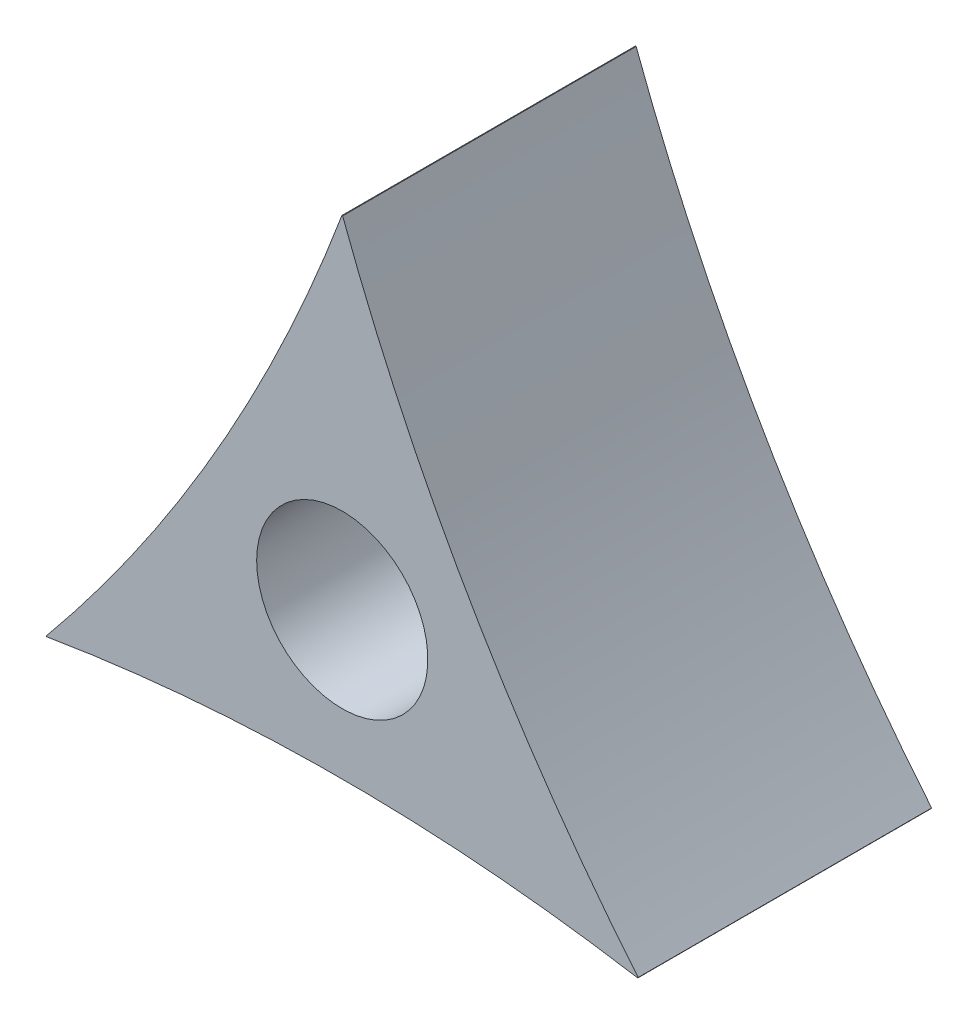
ISO-10303-21;
HEADER;
FILE_DESCRIPTION(('STEP AP214'),'2;1');
FILE_NAME('part.step','',(''),(''),'','','');
FILE_SCHEMA(('AUTOMOTIVE_DESIGN { 1 0 10303 214 1 1 1 1 }'));
ENDSEC;
DATA;
#1=APPLICATION_CONTEXT('core data for automotive mechanical design processes');
#2=APPLICATION_PROTOCOL_DEFINITION('international standard','automotive_design',2000,#1);
#3=PRODUCT_CONTEXT('',#1,'mechanical');
#4=PRODUCT('Part','Part','',(#3));
#5=PRODUCT_RELATED_PRODUCT_CATEGORY('part','',(#4));
#6=PRODUCT_DEFINITION_FORMATION('','',#4);
#7=PRODUCT_DEFINITION_CONTEXT('part definition',#1,'design');
#8=PRODUCT_DEFINITION('design','',#6,#7);
#9=PRODUCT_DEFINITION_SHAPE('','',#8);
#10=(LENGTH_UNIT() NAMED_UNIT(*) SI_UNIT(.MILLI.,.METRE.));
#11=(NAMED_UNIT(*) PLANE_ANGLE_UNIT() SI_UNIT($,.RADIAN.));
#12=(NAMED_UNIT(*) SI_UNIT($,.STERADIAN.) SOLID_ANGLE_UNIT());
#13=UNCERTAINTY_MEASURE_WITH_UNIT(LENGTH_MEASURE(1.E-05),#10,'distance_accuracy_value','');
#14=(GEOMETRIC_REPRESENTATION_CONTEXT(3) GLOBAL_UNCERTAINTY_ASSIGNED_CONTEXT((#13)) GLOBAL_UNIT_ASSIGNED_CONTEXT((#10,
#11,#12)) REPRESENTATION_CONTEXT('',''));
#15=CARTESIAN_POINT('',(0.,0.,0.));
#16=DIRECTION('',(0.,0.,1.));
#17=DIRECTION('',(1.,0.,0.));
#18=AXIS2_PLACEMENT_3D('',#15,#16,#17);
#19=CARTESIAN_POINT('',(-435.480557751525,-251.424817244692,152.4));
#20=DIRECTION('',(0.,0.,-1.));
#21=DIRECTION('',(-1.,0.,0.));
#22=AXIS2_PLACEMENT_3D('',#19,#20,#21);
#23=PLANE('',#22);
#24=CARTESIAN_POINT('',(0.,-1005.69926897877,152.4));
#25=DIRECTION('',(0.,0.,-1.));
#26=DIRECTION('',(1.,0.,0.));
#27=AXIS2_PLACEMENT_3D('',#24,#25,#26);
#28=CIRCLE('',#27,929.64);
#29=CARTESIAN_POINT('',(-153.444496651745,-88.8103356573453,152.4));
#30=VERTEX_POINT('',#29);
#31=CARTESIAN_POINT('',(153.444496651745,-88.8103356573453,152.4));
#32=VERTEX_POINT('',#31);
#33=EDGE_CURVE('E111',#30,#32,#28,.T.);
#34=ORIENTED_EDGE('',*,*,#33,.T.);
#35=DIRECTION('',(-0.500000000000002,-0.866025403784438,0.));
#36=VECTOR('',#35,1.);
#37=CARTESIAN_POINT('',(153.920375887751,-87.9860886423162,152.4));
#38=LINE('',#37,#36);
#39=CARTESIAN_POINT('',(153.634255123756,-88.4816643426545,152.4));
#40=VERTEX_POINT('',#39);
#41=EDGE_CURVE('E175',#40,#32,#38,.T.);
#42=ORIENTED_EDGE('',*,*,#41,.F.);
#43=CARTESIAN_POINT('',(870.961115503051,502.849634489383,152.4));
#44=DIRECTION('',(0.,0.,-1.));
#45=DIRECTION('',(-1.,0.,0.));
#46=AXIS2_PLACEMENT_3D('',#43,#44,#45);
#47=CIRCLE('',#46,929.64);
#48=CARTESIAN_POINT('',(0.189758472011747,177.292,152.4));
#49=VERTEX_POINT('',#48);
#50=EDGE_CURVE('E107',#40,#49,#47,.T.);
#51=ORIENTED_EDGE('',*,*,#50,.T.);
#52=DIRECTION('',(1.,0.,0.));
#53=VECTOR('',#52,1.);
#54=CARTESIAN_POINT('',(0.761999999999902,177.292,152.4));
#55=LINE('',#54,#53);
#56=CARTESIAN_POINT('',(-0.189758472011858,177.292,152.4));
#57=VERTEX_POINT('',#56);
#58=EDGE_CURVE('E59',#57,#49,#55,.T.);
#59=ORIENTED_EDGE('',*,*,#58,.F.);
#60=CARTESIAN_POINT('',(-870.961115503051,502.849634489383,152.4));
#61=DIRECTION('',(0.,0.,-1.));
#62=DIRECTION('',(-1.,0.,0.));
#63=AXIS2_PLACEMENT_3D('',#60,#61,#62);
#64=CIRCLE('',#63,929.64);
#65=CARTESIAN_POINT('',(-153.634255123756,-88.4816643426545,152.4));
#66=VERTEX_POINT('',#65);
#67=EDGE_CURVE('E104',#57,#66,#64,.T.);
#68=ORIENTED_EDGE('',*,*,#67,.T.);
#69=DIRECTION('',(-0.500000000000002,0.866025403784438,0.));
#70=VECTOR('',#69,1.);
#71=CARTESIAN_POINT('',(-153.920375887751,-87.9860886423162,152.4));
#72=LINE('',#71,#70);
#73=EDGE_CURVE('E139',#30,#66,#72,.T.);
#74=ORIENTED_EDGE('',*,*,#73,.F.);
#75=EDGE_LOOP('',(#34,#42,#51,#59,#68,#74));
#76=FACE_BOUND('',#75,.T.);
#77=CARTESIAN_POINT('',(0.,0.,152.4));
#78=DIRECTION('',(0.,0.,1.));
#79=DIRECTION('',(1.,0.,0.));
#80=AXIS2_PLACEMENT_3D('',#77,#78,#79);
#81=CIRCLE('',#80,44.45);
#82=CARTESIAN_POINT('',(-44.45,0.,152.4));
#83=VERTEX_POINT('',#82);
#84=EDGE_CURVE('E126',#83,#83,#81,.T.);
#85=ORIENTED_EDGE('',*,*,#84,.F.);
#86=EDGE_LOOP('',(#85));
#87=FACE_BOUND('',#86,.T.);
#88=ADVANCED_FACE('F37',(#76,#87),#23,.F.);
#89=CARTESIAN_POINT('',(-435.480557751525,-251.424817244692,0.));
#90=DIRECTION('',(0.,0.,-1.));
#91=DIRECTION('',(-1.,0.,0.));
#92=AXIS2_PLACEMENT_3D('',#89,#90,#91);
#93=PLANE('',#92);
#94=DIRECTION('',(-0.500000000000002,-0.866025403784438,0.));
#95=VECTOR('',#94,1.);
#96=CARTESIAN_POINT('',(153.920375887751,-87.9860886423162,0.));
#97=LINE('',#96,#95);
#98=CARTESIAN_POINT('',(153.634255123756,-88.4816643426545,0.));
#99=VERTEX_POINT('',#98);
#100=CARTESIAN_POINT('',(153.444496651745,-88.8103356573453,0.));
#101=VERTEX_POINT('',#100);
#102=EDGE_CURVE('E96',#99,#101,#97,.T.);
#103=ORIENTED_EDGE('',*,*,#102,.T.);
#104=CARTESIAN_POINT('',(0.,-1005.69926897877,0.));
#105=DIRECTION('',(0.,0.,-1.));
#106=DIRECTION('',(1.,0.,0.));
#107=AXIS2_PLACEMENT_3D('',#104,#105,#106);
#108=CIRCLE('',#107,929.64);
#109=CARTESIAN_POINT('',(-153.444496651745,-88.8103356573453,0.));
#110=VERTEX_POINT('',#109);
#111=EDGE_CURVE('E116',#110,#101,#108,.T.);
#112=ORIENTED_EDGE('',*,*,#111,.F.);
#113=DIRECTION('',(-0.500000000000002,0.866025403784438,0.));
#114=VECTOR('',#113,1.);
#115=CARTESIAN_POINT('',(-153.920375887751,-87.9860886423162,0.));
#116=LINE('',#115,#114);
#117=CARTESIAN_POINT('',(-153.634255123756,-88.4816643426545,0.));
#118=VERTEX_POINT('',#117);
#119=EDGE_CURVE('E52',#110,#118,#116,.T.);
#120=ORIENTED_EDGE('',*,*,#119,.T.);
#121=CARTESIAN_POINT('',(-870.961115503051,502.849634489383,0.));
#122=DIRECTION('',(0.,0.,-1.));
#123=DIRECTION('',(-1.,0.,0.));
#124=AXIS2_PLACEMENT_3D('',#121,#122,#123);
#125=CIRCLE('',#124,929.64);
#126=CARTESIAN_POINT('',(-0.189758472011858,177.292,0.));
#127=VERTEX_POINT('',#126);
#128=EDGE_CURVE('E124',#127,#118,#125,.T.);
#129=ORIENTED_EDGE('',*,*,#128,.F.);
#130=DIRECTION('',(1.,0.,0.));
#131=VECTOR('',#130,1.);
#132=CARTESIAN_POINT('',(0.761999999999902,177.292,0.));
#133=LINE('',#132,#131);
#134=CARTESIAN_POINT('',(0.189758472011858,177.292,0.));
#135=VERTEX_POINT('',#134);
#136=EDGE_CURVE('E90',#127,#135,#133,.T.);
#137=ORIENTED_EDGE('',*,*,#136,.T.);
#138=CARTESIAN_POINT('',(870.961115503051,502.849634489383,0.));
#139=DIRECTION('',(0.,0.,-1.));
#140=DIRECTION('',(-1.,0.,0.));
#141=AXIS2_PLACEMENT_3D('',#138,#139,#140);
#142=CIRCLE('',#141,929.64);
#143=EDGE_CURVE('E112',#99,#135,#142,.T.);
#144=ORIENTED_EDGE('',*,*,#143,.F.);
#145=EDGE_LOOP('',(#103,#112,#120,#129,#137,#144));
#146=FACE_BOUND('',#145,.T.);
#147=CARTESIAN_POINT('',(0.,0.,0.));
#148=DIRECTION('',(0.,0.,1.));
#149=DIRECTION('',(1.,0.,0.));
#150=AXIS2_PLACEMENT_3D('',#147,#148,#149);
#151=CIRCLE('',#150,44.45);
#152=CARTESIAN_POINT('',(-44.45,0.,0.));
#153=VERTEX_POINT('',#152);
#154=EDGE_CURVE('E119',#153,#153,#151,.T.);
#155=ORIENTED_EDGE('',*,*,#154,.T.);
#156=EDGE_LOOP('',(#155));
#157=FACE_BOUND('',#156,.T.);
#158=ADVANCED_FACE('F136',(#146,#157),#93,.T.);
#159=CARTESIAN_POINT('',(-870.961115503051,502.849634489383,152.4));
#160=DIRECTION('',(0.,0.,-1.));
#161=DIRECTION('',(-1.,0.,0.));
#162=AXIS2_PLACEMENT_3D('',#159,#160,#161);
#163=CYLINDRICAL_SURFACE('',#162,929.64);
#164=ORIENTED_EDGE('',*,*,#128,.T.);
#165=DIRECTION('',(0.,0.,-1.));
#166=VECTOR('',#165,1.);
#167=CARTESIAN_POINT('',(-153.634255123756,-88.4816643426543,152.4));
#168=LINE('',#167,#166);
#169=EDGE_CURVE('E110',#118,#66,#168,.F.);
#170=ORIENTED_EDGE('',*,*,#169,.T.);
#171=ORIENTED_EDGE('',*,*,#67,.F.);
#172=DIRECTION('',(0.,0.,-1.));
#173=VECTOR('',#172,1.);
#174=CARTESIAN_POINT('',(-0.189758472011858,177.292,152.4));
#175=LINE('',#174,#173);
#176=EDGE_CURVE('E87',#57,#127,#175,.T.);
#177=ORIENTED_EDGE('',*,*,#176,.T.);
#178=EDGE_LOOP('',(#164,#170,#171,#177));
#179=FACE_BOUND('',#178,.T.);
#180=ADVANCED_FACE('F39',(#179),#163,.F.);
#181=CARTESIAN_POINT('',(0.,-1005.69926897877,152.4));
#182=DIRECTION('',(0.,0.,-1.));
#183=DIRECTION('',(-1.,0.,0.));
#184=AXIS2_PLACEMENT_3D('',#181,#182,#183);
#185=CYLINDRICAL_SURFACE('',#184,929.64);
#186=ORIENTED_EDGE('',*,*,#111,.T.);
#187=DIRECTION('',(0.,0.,-1.));
#188=VECTOR('',#187,1.);
#189=CARTESIAN_POINT('',(153.444496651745,-88.8103356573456,152.4));
#190=LINE('',#189,#188);
#191=EDGE_CURVE('E95',#101,#32,#190,.F.);
#192=ORIENTED_EDGE('',*,*,#191,.T.);
#193=ORIENTED_EDGE('',*,*,#33,.F.);
#194=DIRECTION('',(0.,0.,-1.));
#195=VECTOR('',#194,1.);
#196=CARTESIAN_POINT('',(-153.444496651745,-88.8103356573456,152.4));
#197=LINE('',#196,#195);
#198=EDGE_CURVE('E11',#30,#110,#197,.T.);
#199=ORIENTED_EDGE('',*,*,#198,.T.);
#200=EDGE_LOOP('',(#186,#192,#193,#199));
#201=FACE_BOUND('',#200,.T.);
#202=ADVANCED_FACE('F161',(#201),#185,.F.);
#203=CARTESIAN_POINT('',(870.961115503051,502.849634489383,152.4));
#204=DIRECTION('',(0.,0.,-1.));
#205=DIRECTION('',(-1.,0.,0.));
#206=AXIS2_PLACEMENT_3D('',#203,#204,#205);
#207=CYLINDRICAL_SURFACE('',#206,929.64);
#208=ORIENTED_EDGE('',*,*,#50,.F.);
#209=DIRECTION('',(0.,0.,-1.));
#210=VECTOR('',#209,1.);
#211=CARTESIAN_POINT('',(153.634255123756,-88.4816643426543,152.4));
#212=LINE('',#211,#210);
#213=EDGE_CURVE('E45',#40,#99,#212,.T.);
#214=ORIENTED_EDGE('',*,*,#213,.T.);
#215=ORIENTED_EDGE('',*,*,#143,.T.);
#216=DIRECTION('',(0.,0.,-1.));
#217=VECTOR('',#216,1.);
#218=CARTESIAN_POINT('',(0.189758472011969,177.292,152.4));
#219=LINE('',#218,#217);
#220=EDGE_CURVE('E123',#135,#49,#219,.F.);
#221=ORIENTED_EDGE('',*,*,#220,.T.);
#222=EDGE_LOOP('',(#208,#214,#215,#221));
#223=FACE_BOUND('',#222,.T.);
#224=ADVANCED_FACE('F132',(#223),#207,.F.);
#225=CARTESIAN_POINT('',(0.,0.,152.4));
#226=DIRECTION('',(0.,0.,-1.));
#227=DIRECTION('',(-1.,0.,0.));
#228=AXIS2_PLACEMENT_3D('',#225,#226,#227);
#229=CYLINDRICAL_SURFACE('',#228,44.45);
#230=CARTESIAN_POINT('',(-44.45,0.,152.4));
#231=CARTESIAN_POINT('',(-44.45,0.,150.8125));
#232=CARTESIAN_POINT('',(-44.45,0.,149.225));
#233=CARTESIAN_POINT('',(-44.45,0.,146.05));
#234=CARTESIAN_POINT('',(-44.45,0.,144.4625));
#235=CARTESIAN_POINT('',(-44.45,0.,141.2875));
#236=CARTESIAN_POINT('',(-44.45,0.,139.7));
#237=CARTESIAN_POINT('',(-44.45,0.,136.525));
#238=CARTESIAN_POINT('',(-44.45,0.,134.9375));
#239=CARTESIAN_POINT('',(-44.45,0.,131.7625));
#240=CARTESIAN_POINT('',(-44.45,0.,130.175));
#241=CARTESIAN_POINT('',(-44.45,0.,127.));
#242=CARTESIAN_POINT('',(-44.45,0.,125.4125));
#243=CARTESIAN_POINT('',(-44.45,0.,122.2375));
#244=CARTESIAN_POINT('',(-44.45,0.,120.65));
#245=CARTESIAN_POINT('',(-44.45,0.,117.475));
#246=CARTESIAN_POINT('',(-44.45,0.,115.8875));
#247=CARTESIAN_POINT('',(-44.45,0.,112.7125));
#248=CARTESIAN_POINT('',(-44.45,0.,111.125));
#249=CARTESIAN_POINT('',(-44.45,0.,107.95));
#250=CARTESIAN_POINT('',(-44.45,0.,106.3625));
#251=CARTESIAN_POINT('',(-44.45,0.,103.1875));
#252=CARTESIAN_POINT('',(-44.45,0.,101.6));
#253=CARTESIAN_POINT('',(-44.45,0.,98.425));
#254=CARTESIAN_POINT('',(-44.45,0.,96.8375));
#255=CARTESIAN_POINT('',(-44.45,0.,93.6625));
#256=CARTESIAN_POINT('',(-44.45,0.,92.075));
#257=CARTESIAN_POINT('',(-44.45,0.,88.9));
#258=CARTESIAN_POINT('',(-44.45,0.,87.3125));
#259=CARTESIAN_POINT('',(-44.45,0.,84.1375));
#260=CARTESIAN_POINT('',(-44.45,0.,82.55));
#261=CARTESIAN_POINT('',(-44.45,0.,79.375));
#262=CARTESIAN_POINT('',(-44.45,0.,77.7875));
#263=CARTESIAN_POINT('',(-44.45,0.,74.6125));
#264=CARTESIAN_POINT('',(-44.45,0.,73.025));
#265=CARTESIAN_POINT('',(-44.45,0.,69.85));
#266=CARTESIAN_POINT('',(-44.45,0.,68.2625));
#267=CARTESIAN_POINT('',(-44.45,0.,65.0875));
#268=CARTESIAN_POINT('',(-44.45,0.,63.5));
#269=CARTESIAN_POINT('',(-44.45,0.,60.325));
#270=CARTESIAN_POINT('',(-44.45,0.,58.7375));
#271=CARTESIAN_POINT('',(-44.45,0.,55.5625));
#272=CARTESIAN_POINT('',(-44.45,0.,53.975));
#273=CARTESIAN_POINT('',(-44.45,0.,50.8));
#274=CARTESIAN_POINT('',(-44.45,0.,49.2125));
#275=CARTESIAN_POINT('',(-44.45,0.,46.0375));
#276=CARTESIAN_POINT('',(-44.45,0.,44.45));
#277=CARTESIAN_POINT('',(-44.45,0.,41.275));
#278=CARTESIAN_POINT('',(-44.45,0.,39.6875));
#279=CARTESIAN_POINT('',(-44.45,0.,36.5125));
#280=CARTESIAN_POINT('',(-44.45,0.,34.925));
#281=CARTESIAN_POINT('',(-44.45,0.,31.75));
#282=CARTESIAN_POINT('',(-44.45,0.,30.1625));
#283=CARTESIAN_POINT('',(-44.45,0.,26.9875));
#284=CARTESIAN_POINT('',(-44.45,0.,25.4));
#285=CARTESIAN_POINT('',(-44.45,0.,22.225));
#286=CARTESIAN_POINT('',(-44.45,0.,20.6375));
#287=CARTESIAN_POINT('',(-44.45,0.,17.4625));
#288=CARTESIAN_POINT('',(-44.45,0.,15.875));
#289=CARTESIAN_POINT('',(-44.45,0.,12.7));
#290=CARTESIAN_POINT('',(-44.45,0.,11.1125));
#291=CARTESIAN_POINT('',(-44.45,0.,7.93750000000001));
#292=CARTESIAN_POINT('',(-44.45,0.,6.35));
#293=CARTESIAN_POINT('',(-44.45,0.,3.175));
#294=CARTESIAN_POINT('',(-44.45,0.,1.5875));
#295=CARTESIAN_POINT('',(-44.45,0.,0.));
#296=B_SPLINE_CURVE_WITH_KNOTS('',3,(#230,#231,#232,#233,#234,#235,#236,#237,#238,#239,#240,
#241,#242,#243,#244,#245,#246,#247,#248,#249,#250,#251,#252,#253,#254,#255,#256,#257,#258,#259,
#260,#261,#262,#263,#264,#265,#266,#267,#268,#269,#270,#271,#272,#273,#274,#275,#276,#277,#278,
#279,#280,#281,#282,#283,#284,#285,#286,#287,#288,#289,#290,#291,#292,#293,#294,#295),
.UNSPECIFIED.,.F.,.F.,(4,2,2,2,2,2,2,2,2,2,2,2,2,2,2,2,2,2,2,2,2,2,2,2,2,2,2,2,2,2,2,2,4),(0.,
4.76249999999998,9.52499999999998,14.2875,19.05,23.8125,28.575,33.3375,38.1,42.8625,47.625,
52.3875,57.15,61.9125,66.675,71.4375,76.2,80.9625,85.725,90.4875,95.25,100.0125,104.775,
109.5375,114.3,119.0625,123.825,128.5875,133.35,138.1125,142.875,147.6375,152.4),.UNSPECIFIED.);
#297=EDGE_CURVE('BSEAM152',#83,#153,#296,.T.);
#298=ORIENTED_EDGE('',*,*,#84,.T.);
#299=ORIENTED_EDGE('',*,*,#154,.F.);
#300=ORIENTED_EDGE('',*,*,#297,.T.);
#301=ORIENTED_EDGE('',*,*,#297,.F.);
#302=EDGE_LOOP('',(#298,#300,#299,#301));
#303=FACE_BOUND('',#302,.T.);
#304=ADVANCED_FACE('F152',(#303),#229,.F.);
#305=CARTESIAN_POINT('',(0.761999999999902,177.292,0.));
#306=DIRECTION('',(0.,-1.,0.));
#307=DIRECTION('',(1.,0.,0.));
#308=AXIS2_PLACEMENT_3D('',#305,#306,#307);
#309=PLANE('',#308);
#310=ORIENTED_EDGE('',*,*,#58,.T.);
#311=ORIENTED_EDGE('',*,*,#220,.F.);
#312=ORIENTED_EDGE('',*,*,#136,.F.);
#313=ORIENTED_EDGE('',*,*,#176,.F.);
#314=EDGE_LOOP('',(#310,#311,#312,#313));
#315=FACE_BOUND('',#314,.T.);
#316=ADVANCED_FACE('F88',(#315),#309,.F.);
#317=CARTESIAN_POINT('',(153.920375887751,-87.9860886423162,0.));
#318=DIRECTION('',(-0.866025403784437,0.500000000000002,0.));
#319=DIRECTION('',(-0.500000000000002,-0.866025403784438,0.));
#320=AXIS2_PLACEMENT_3D('',#317,#318,#319);
#321=PLANE('',#320);
#322=ORIENTED_EDGE('',*,*,#102,.F.);
#323=ORIENTED_EDGE('',*,*,#213,.F.);
#324=ORIENTED_EDGE('',*,*,#41,.T.);
#325=ORIENTED_EDGE('',*,*,#191,.F.);
#326=EDGE_LOOP('',(#322,#323,#324,#325));
#327=FACE_BOUND('',#326,.T.);
#328=ADVANCED_FACE('F159',(#327),#321,.F.);
#329=CARTESIAN_POINT('',(-153.920375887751,-87.9860886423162,0.));
#330=DIRECTION('',(0.866025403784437,0.500000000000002,0.));
#331=DIRECTION('',(-0.500000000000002,0.866025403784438,0.));
#332=AXIS2_PLACEMENT_3D('',#329,#330,#331);
#333=PLANE('',#332);
#334=ORIENTED_EDGE('',*,*,#119,.F.);
#335=ORIENTED_EDGE('',*,*,#198,.F.);
#336=ORIENTED_EDGE('',*,*,#73,.T.);
#337=ORIENTED_EDGE('',*,*,#169,.F.);
#338=EDGE_LOOP('',(#334,#335,#336,#337));
#339=FACE_BOUND('',#338,.T.);
#340=ADVANCED_FACE('F178',(#339),#333,.F.);
#341=CLOSED_SHELL('',(#88,#158,#180,#202,#224,#304,#316,#328,#340));
#342=MANIFOLD_SOLID_BREP('B2',#341);
#343=ADVANCED_BREP_SHAPE_REPRESENTATION('',(#18,#342),#14);
#344=SHAPE_DEFINITION_REPRESENTATION(#9,#343);
ENDSEC;
END-ISO-10303-21;
